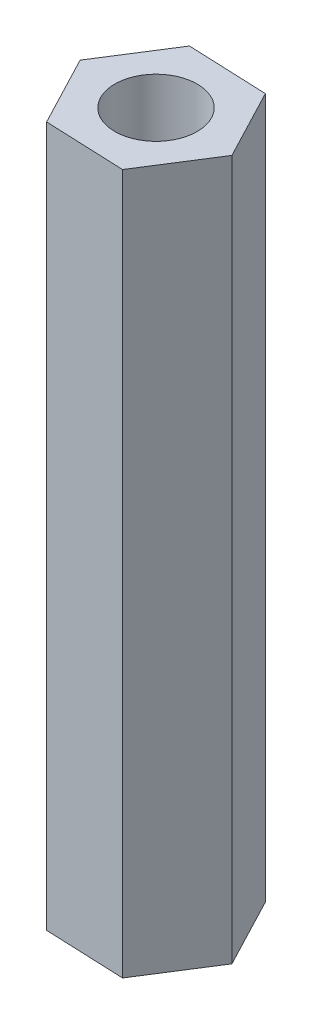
ISO-10303-21;
HEADER;
FILE_DESCRIPTION(('STEP AP214'),'2;1');
FILE_NAME('part.step','',(''),(''),'','','');
FILE_SCHEMA(('AUTOMOTIVE_DESIGN { 1 0 10303 214 1 1 1 1 }'));
ENDSEC;
DATA;
#1=APPLICATION_CONTEXT('core data for automotive mechanical design processes');
#2=APPLICATION_PROTOCOL_DEFINITION('international standard','automotive_design',2000,#1);
#3=PRODUCT_CONTEXT('',#1,'mechanical');
#4=PRODUCT('Part','Part','',(#3));
#5=PRODUCT_RELATED_PRODUCT_CATEGORY('part','',(#4));
#6=PRODUCT_DEFINITION_FORMATION('','',#4);
#7=PRODUCT_DEFINITION_CONTEXT('part definition',#1,'design');
#8=PRODUCT_DEFINITION('design','',#6,#7);
#9=PRODUCT_DEFINITION_SHAPE('','',#8);
#10=(LENGTH_UNIT() NAMED_UNIT(*) SI_UNIT(.MILLI.,.METRE.));
#11=(NAMED_UNIT(*) PLANE_ANGLE_UNIT() SI_UNIT($,.RADIAN.));
#12=(NAMED_UNIT(*) SI_UNIT($,.STERADIAN.) SOLID_ANGLE_UNIT());
#13=UNCERTAINTY_MEASURE_WITH_UNIT(LENGTH_MEASURE(1.E-05),#10,'distance_accuracy_value','');
#14=(GEOMETRIC_REPRESENTATION_CONTEXT(3) GLOBAL_UNCERTAINTY_ASSIGNED_CONTEXT((#13)) GLOBAL_UNIT_ASSIGNED_CONTEXT((#10,
#11,#12)) REPRESENTATION_CONTEXT('',''));
#15=CARTESIAN_POINT('',(0.,0.,0.));
#16=DIRECTION('',(0.,0.,1.));
#17=DIRECTION('',(1.,0.,0.));
#18=AXIS2_PLACEMENT_3D('',#15,#16,#17);
#19=CARTESIAN_POINT('',(0.,25.5,0.));
#20=DIRECTION('',(0.,1.,0.));
#21=DIRECTION('',(0.,0.,1.));
#22=AXIS2_PLACEMENT_3D('',#19,#20,#21);
#23=PLANE('',#22);
#24=DIRECTION('',(0.999140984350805,0.,0.0414402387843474));
#25=VECTOR('',#24,1.);
#26=CARTESIAN_POINT('',(-1.54573638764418,25.5,2.43803862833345));
#27=LINE('',#26,#25);
#28=CARTESIAN_POINT('',(-1.54573638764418,25.5,2.43803862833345));
#29=VERTEX_POINT('',#28);
#30=CARTESIAN_POINT('',(1.33853519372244,25.5,2.55766629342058));
#31=VERTEX_POINT('',#30);
#32=EDGE_CURVE('E152',#29,#31,#27,.T.);
#33=ORIENTED_EDGE('',*,*,#32,.T.);
#34=DIRECTION('',(0.535458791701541,0.,-0.844561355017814));
#35=VECTOR('',#34,1.);
#36=CARTESIAN_POINT('',(1.33853519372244,25.5,2.55766629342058));
#37=LINE('',#36,#35);
#38=CARTESIAN_POINT('',(2.88427158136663,25.5,0.119627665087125));
#39=VERTEX_POINT('',#38);
#40=EDGE_CURVE('E100',#31,#39,#37,.T.);
#41=ORIENTED_EDGE('',*,*,#40,.T.);
#42=DIRECTION('',(-0.463682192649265,0.,-0.886001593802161));
#43=VECTOR('',#42,1.);
#44=CARTESIAN_POINT('',(2.88427158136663,25.5,0.119627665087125));
#45=LINE('',#44,#43);
#46=CARTESIAN_POINT('',(1.54573638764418,25.5,-2.43803862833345));
#47=VERTEX_POINT('',#46);
#48=EDGE_CURVE('E113',#39,#47,#45,.T.);
#49=ORIENTED_EDGE('',*,*,#48,.T.);
#50=DIRECTION('',(-0.999140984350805,0.,-0.0414402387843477));
#51=VECTOR('',#50,1.);
#52=CARTESIAN_POINT('',(1.54573638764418,25.5,-2.43803862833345));
#53=LINE('',#52,#51);
#54=CARTESIAN_POINT('',(-1.33853519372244,25.5,-2.55766629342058));
#55=VERTEX_POINT('',#54);
#56=EDGE_CURVE('E107',#47,#55,#53,.T.);
#57=ORIENTED_EDGE('',*,*,#56,.T.);
#58=DIRECTION('',(-0.53545879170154,0.,0.844561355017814));
#59=VECTOR('',#58,1.);
#60=CARTESIAN_POINT('',(-1.33853519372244,25.5,-2.55766629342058));
#61=LINE('',#60,#59);
#62=CARTESIAN_POINT('',(-2.88427158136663,25.5,-0.119627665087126));
#63=VERTEX_POINT('',#62);
#64=EDGE_CURVE('E111',#55,#63,#61,.T.);
#65=ORIENTED_EDGE('',*,*,#64,.T.);
#66=DIRECTION('',(0.463682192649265,0.,0.886001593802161));
#67=VECTOR('',#66,1.);
#68=CARTESIAN_POINT('',(-2.88427158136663,25.5,-0.119627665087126));
#69=LINE('',#68,#67);
#70=EDGE_CURVE('E63',#63,#29,#69,.T.);
#71=ORIENTED_EDGE('',*,*,#70,.T.);
#72=EDGE_LOOP('',(#33,#41,#49,#57,#65,#71));
#73=FACE_BOUND('',#72,.T.);
#74=CARTESIAN_POINT('',(0.,25.5,0.));
#75=DIRECTION('',(0.,1.,0.));
#76=DIRECTION('',(0.,0.,1.));
#77=AXIS2_PLACEMENT_3D('',#74,#75,#76);
#78=CIRCLE('',#77,1.5);
#79=CARTESIAN_POINT('',(0.,25.5,1.5));
#80=VERTEX_POINT('',#79);
#81=EDGE_CURVE('E140',#80,#80,#78,.T.);
#82=ORIENTED_EDGE('',*,*,#81,.F.);
#83=EDGE_LOOP('',(#82));
#84=FACE_BOUND('',#83,.T.);
#85=ADVANCED_FACE('F45',(#73,#84),#23,.T.);
#86=CARTESIAN_POINT('',(0.,0.,0.));
#87=DIRECTION('',(0.,1.,0.));
#88=DIRECTION('',(0.,0.,1.));
#89=AXIS2_PLACEMENT_3D('',#86,#87,#88);
#90=PLANE('',#89);
#91=DIRECTION('',(0.999140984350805,0.,0.0414402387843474));
#92=VECTOR('',#91,1.);
#93=CARTESIAN_POINT('',(-1.54573638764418,0.,2.43803862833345));
#94=LINE('',#93,#92);
#95=CARTESIAN_POINT('',(-1.54573638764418,0.,2.43803862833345));
#96=VERTEX_POINT('',#95);
#97=CARTESIAN_POINT('',(1.33853519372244,0.,2.55766629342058));
#98=VERTEX_POINT('',#97);
#99=EDGE_CURVE('E135',#96,#98,#94,.T.);
#100=ORIENTED_EDGE('',*,*,#99,.F.);
#101=DIRECTION('',(0.463682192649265,0.,0.886001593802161));
#102=VECTOR('',#101,1.);
#103=CARTESIAN_POINT('',(-2.88427158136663,0.,-0.119627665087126));
#104=LINE('',#103,#102);
#105=CARTESIAN_POINT('',(-2.88427158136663,0.,-0.119627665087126));
#106=VERTEX_POINT('',#105);
#107=EDGE_CURVE('E92',#106,#96,#104,.T.);
#108=ORIENTED_EDGE('',*,*,#107,.F.);
#109=DIRECTION('',(-0.53545879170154,0.,0.844561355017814));
#110=VECTOR('',#109,1.);
#111=CARTESIAN_POINT('',(-1.33853519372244,0.,-2.55766629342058));
#112=LINE('',#111,#110);
#113=CARTESIAN_POINT('',(-1.33853519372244,0.,-2.55766629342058));
#114=VERTEX_POINT('',#113);
#115=EDGE_CURVE('E86',#114,#106,#112,.T.);
#116=ORIENTED_EDGE('',*,*,#115,.F.);
#117=DIRECTION('',(-0.999140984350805,0.,-0.0414402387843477));
#118=VECTOR('',#117,1.);
#119=CARTESIAN_POINT('',(1.54573638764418,0.,-2.43803862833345));
#120=LINE('',#119,#118);
#121=CARTESIAN_POINT('',(1.54573638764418,0.,-2.43803862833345));
#122=VERTEX_POINT('',#121);
#123=EDGE_CURVE('E122',#122,#114,#120,.T.);
#124=ORIENTED_EDGE('',*,*,#123,.F.);
#125=DIRECTION('',(-0.463682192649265,0.,-0.886001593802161));
#126=VECTOR('',#125,1.);
#127=CARTESIAN_POINT('',(2.88427158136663,0.,0.119627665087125));
#128=LINE('',#127,#126);
#129=CARTESIAN_POINT('',(2.88427158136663,0.,0.119627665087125));
#130=VERTEX_POINT('',#129);
#131=EDGE_CURVE('E143',#130,#122,#128,.T.);
#132=ORIENTED_EDGE('',*,*,#131,.F.);
#133=DIRECTION('',(0.535458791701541,0.,-0.844561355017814));
#134=VECTOR('',#133,1.);
#135=CARTESIAN_POINT('',(1.33853519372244,0.,2.55766629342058));
#136=LINE('',#135,#134);
#137=EDGE_CURVE('E139',#98,#130,#136,.T.);
#138=ORIENTED_EDGE('',*,*,#137,.F.);
#139=EDGE_LOOP('',(#100,#108,#116,#124,#132,#138));
#140=FACE_BOUND('',#139,.T.);
#141=CARTESIAN_POINT('',(0.,0.,0.));
#142=DIRECTION('',(0.,1.,0.));
#143=DIRECTION('',(0.,0.,1.));
#144=AXIS2_PLACEMENT_3D('',#141,#142,#143);
#145=CIRCLE('',#144,1.5);
#146=CARTESIAN_POINT('',(0.,0.,1.5));
#147=VERTEX_POINT('',#146);
#148=EDGE_CURVE('E249',#147,#147,#145,.T.);
#149=ORIENTED_EDGE('',*,*,#148,.T.);
#150=EDGE_LOOP('',(#149));
#151=FACE_BOUND('',#150,.T.);
#152=ADVANCED_FACE('F165',(#140,#151),#90,.F.);
#153=CARTESIAN_POINT('',(-1.54573638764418,25.5,2.43803862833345));
#154=DIRECTION('',(0.0414402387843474,0.,-0.999140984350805));
#155=DIRECTION('',(-0.999140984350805,0.,-0.0414402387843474));
#156=AXIS2_PLACEMENT_3D('',#153,#154,#155);
#157=PLANE('',#156);
#158=ORIENTED_EDGE('',*,*,#99,.T.);
#159=DIRECTION('',(0.,-1.,0.));
#160=VECTOR('',#159,1.);
#161=CARTESIAN_POINT('',(1.33853519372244,25.5,2.55766629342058));
#162=LINE('',#161,#160);
#163=EDGE_CURVE('E11',#31,#98,#162,.T.);
#164=ORIENTED_EDGE('',*,*,#163,.F.);
#165=ORIENTED_EDGE('',*,*,#32,.F.);
#166=DIRECTION('',(0.,-1.,0.));
#167=VECTOR('',#166,1.);
#168=CARTESIAN_POINT('',(-1.54573638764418,25.5,2.43803862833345));
#169=LINE('',#168,#167);
#170=EDGE_CURVE('E131',#29,#96,#169,.T.);
#171=ORIENTED_EDGE('',*,*,#170,.T.);
#172=EDGE_LOOP('',(#158,#164,#165,#171));
#173=FACE_BOUND('',#172,.T.);
#174=ADVANCED_FACE('F47',(#173),#157,.F.);
#175=CARTESIAN_POINT('',(1.33853519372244,25.5,2.55766629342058));
#176=DIRECTION('',(-0.844561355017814,0.,-0.535458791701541));
#177=DIRECTION('',(-0.535458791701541,0.,0.844561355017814));
#178=AXIS2_PLACEMENT_3D('',#175,#176,#177);
#179=PLANE('',#178);
#180=ORIENTED_EDGE('',*,*,#137,.T.);
#181=DIRECTION('',(0.,-1.,0.));
#182=VECTOR('',#181,1.);
#183=CARTESIAN_POINT('',(2.88427158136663,25.5,0.119627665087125));
#184=LINE('',#183,#182);
#185=EDGE_CURVE('E55',#39,#130,#184,.T.);
#186=ORIENTED_EDGE('',*,*,#185,.F.);
#187=ORIENTED_EDGE('',*,*,#40,.F.);
#188=ORIENTED_EDGE('',*,*,#163,.T.);
#189=EDGE_LOOP('',(#180,#186,#187,#188));
#190=FACE_BOUND('',#189,.T.);
#191=ADVANCED_FACE('F190',(#190),#179,.F.);
#192=CARTESIAN_POINT('',(2.88427158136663,25.5,0.119627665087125));
#193=DIRECTION('',(-0.886001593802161,0.,0.463682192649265));
#194=DIRECTION('',(0.463682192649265,0.,0.886001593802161));
#195=AXIS2_PLACEMENT_3D('',#192,#193,#194);
#196=PLANE('',#195);
#197=ORIENTED_EDGE('',*,*,#131,.T.);
#198=DIRECTION('',(0.,-1.,0.));
#199=VECTOR('',#198,1.);
#200=CARTESIAN_POINT('',(1.54573638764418,25.5,-2.43803862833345));
#201=LINE('',#200,#199);
#202=EDGE_CURVE('E124',#47,#122,#201,.T.);
#203=ORIENTED_EDGE('',*,*,#202,.F.);
#204=ORIENTED_EDGE('',*,*,#48,.F.);
#205=ORIENTED_EDGE('',*,*,#185,.T.);
#206=EDGE_LOOP('',(#197,#203,#204,#205));
#207=FACE_BOUND('',#206,.T.);
#208=ADVANCED_FACE('F162',(#207),#196,.F.);
#209=CARTESIAN_POINT('',(1.54573638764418,25.5,-2.43803862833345));
#210=DIRECTION('',(-0.0414402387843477,0.,0.999140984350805));
#211=DIRECTION('',(0.999140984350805,0.,0.0414402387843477));
#212=AXIS2_PLACEMENT_3D('',#209,#210,#211);
#213=PLANE('',#212);
#214=ORIENTED_EDGE('',*,*,#123,.T.);
#215=DIRECTION('',(0.,-1.,0.));
#216=VECTOR('',#215,1.);
#217=CARTESIAN_POINT('',(-1.33853519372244,25.5,-2.55766629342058));
#218=LINE('',#217,#216);
#219=EDGE_CURVE('E119',#55,#114,#218,.T.);
#220=ORIENTED_EDGE('',*,*,#219,.F.);
#221=ORIENTED_EDGE('',*,*,#56,.F.);
#222=ORIENTED_EDGE('',*,*,#202,.T.);
#223=EDGE_LOOP('',(#214,#220,#221,#222));
#224=FACE_BOUND('',#223,.T.);
#225=ADVANCED_FACE('F120',(#224),#213,.F.);
#226=CARTESIAN_POINT('',(-1.33853519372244,25.5,-2.55766629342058));
#227=DIRECTION('',(0.844561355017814,0.,0.535458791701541));
#228=DIRECTION('',(0.535458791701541,0.,-0.844561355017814));
#229=AXIS2_PLACEMENT_3D('',#226,#227,#228);
#230=PLANE('',#229);
#231=ORIENTED_EDGE('',*,*,#115,.T.);
#232=DIRECTION('',(0.,-1.,0.));
#233=VECTOR('',#232,1.);
#234=CARTESIAN_POINT('',(-2.88427158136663,25.5,-0.119627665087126));
#235=LINE('',#234,#233);
#236=EDGE_CURVE('E125',#63,#106,#235,.T.);
#237=ORIENTED_EDGE('',*,*,#236,.F.);
#238=ORIENTED_EDGE('',*,*,#64,.F.);
#239=ORIENTED_EDGE('',*,*,#219,.T.);
#240=EDGE_LOOP('',(#231,#237,#238,#239));
#241=FACE_BOUND('',#240,.T.);
#242=ADVANCED_FACE('F127',(#241),#230,.F.);
#243=CARTESIAN_POINT('',(-2.88427158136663,25.5,-0.119627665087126));
#244=DIRECTION('',(0.886001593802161,0.,-0.463682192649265));
#245=DIRECTION('',(-0.463682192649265,0.,-0.886001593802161));
#246=AXIS2_PLACEMENT_3D('',#243,#244,#245);
#247=PLANE('',#246);
#248=ORIENTED_EDGE('',*,*,#107,.T.);
#249=ORIENTED_EDGE('',*,*,#170,.F.);
#250=ORIENTED_EDGE('',*,*,#70,.F.);
#251=ORIENTED_EDGE('',*,*,#236,.T.);
#252=EDGE_LOOP('',(#248,#249,#250,#251));
#253=FACE_BOUND('',#252,.T.);
#254=ADVANCED_FACE('F170',(#253),#247,.F.);
#255=CARTESIAN_POINT('',(0.,25.5,0.));
#256=DIRECTION('',(0.,-1.,0.));
#257=DIRECTION('',(0.,0.,-1.));
#258=AXIS2_PLACEMENT_3D('',#255,#256,#257);
#259=CYLINDRICAL_SURFACE('',#258,1.5);
#260=ORIENTED_EDGE('',*,*,#81,.T.);
#261=EDGE_LOOP('',(#260));
#262=FACE_BOUND('',#261,.T.);
#263=ORIENTED_EDGE('',*,*,#148,.F.);
#264=EDGE_LOOP('',(#263));
#265=FACE_BOUND('',#264,.T.);
#266=ADVANCED_FACE('F172',(#262,#265),#259,.F.);
#267=CLOSED_SHELL('',(#85,#152,#174,#191,#208,#225,#242,#254,#266));
#268=MANIFOLD_SOLID_BREP('B2',#267);
#269=ADVANCED_BREP_SHAPE_REPRESENTATION('',(#18,#268),#14);
#270=SHAPE_DEFINITION_REPRESENTATION(#9,#269);
ENDSEC;
END-ISO-10303-21;
